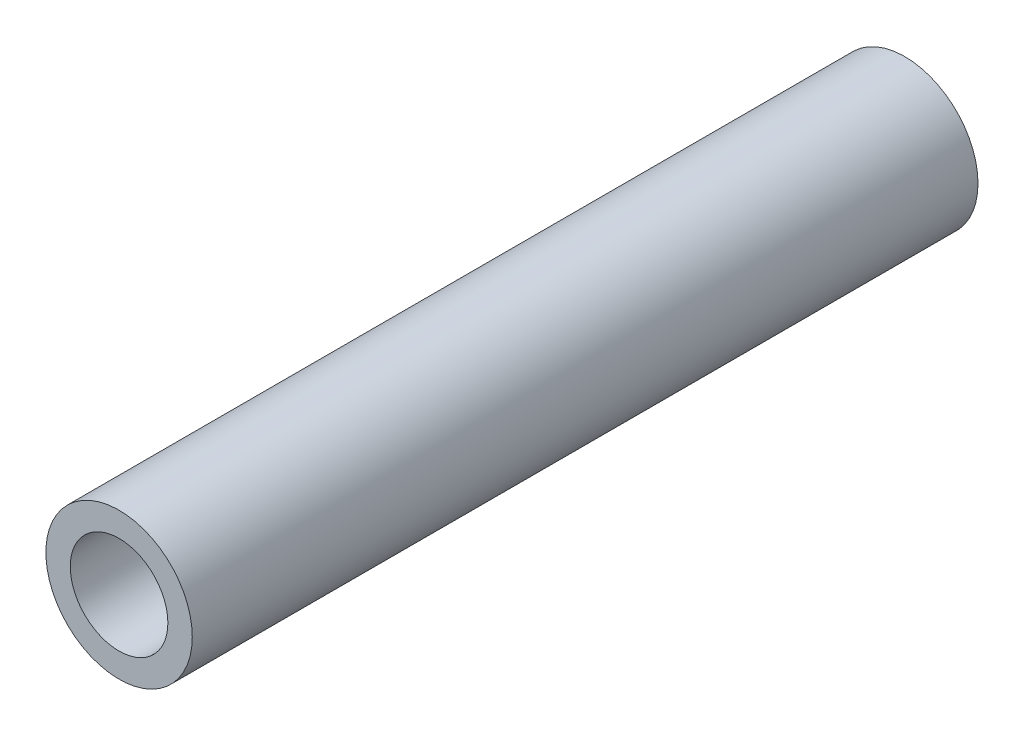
from build123d import *

# Parameters (mm, degrees)
SKETCH_1_R      = 1.5
SKETCH_1_R_2    = 1
EXTRUDE_1_DEPTH = 16.1


with BuildPart() as part:
    # Sketch 1 → Extrude 1 (new body)
    with BuildSketch(Plane.XY):
        Circle(SKETCH_1_R)
        Circle(SKETCH_1_R_2, mode=Mode.SUBTRACT)
    extrude(amount=EXTRUDE_1_DEPTH)


solid = part.part
